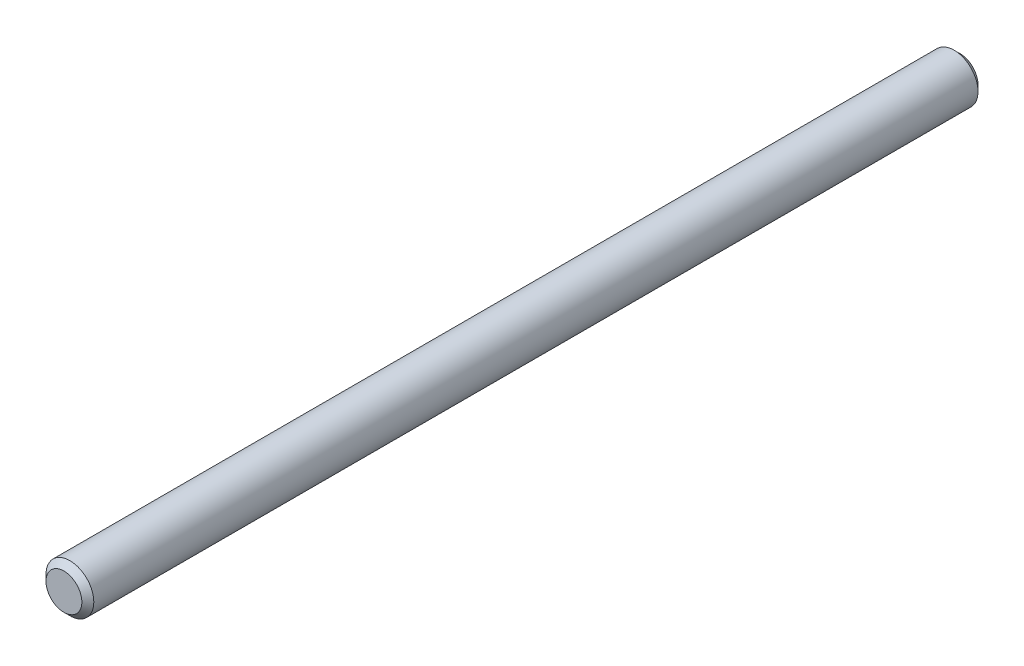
ISO-10303-21;
HEADER;
FILE_DESCRIPTION(('STEP AP214'),'2;1');
FILE_NAME('part.step','',(''),(''),'','','');
FILE_SCHEMA(('AUTOMOTIVE_DESIGN { 1 0 10303 214 1 1 1 1 }'));
ENDSEC;
DATA;
#1=APPLICATION_CONTEXT('core data for automotive mechanical design processes');
#2=APPLICATION_PROTOCOL_DEFINITION('international standard','automotive_design',2000,#1);
#3=PRODUCT_CONTEXT('',#1,'mechanical');
#4=PRODUCT('Part','Part','',(#3));
#5=PRODUCT_RELATED_PRODUCT_CATEGORY('part','',(#4));
#6=PRODUCT_DEFINITION_FORMATION('','',#4);
#7=PRODUCT_DEFINITION_CONTEXT('part definition',#1,'design');
#8=PRODUCT_DEFINITION('design','',#6,#7);
#9=PRODUCT_DEFINITION_SHAPE('','',#8);
#10=(LENGTH_UNIT() NAMED_UNIT(*) SI_UNIT(.MILLI.,.METRE.));
#11=(NAMED_UNIT(*) PLANE_ANGLE_UNIT() SI_UNIT($,.RADIAN.));
#12=(NAMED_UNIT(*) SI_UNIT($,.STERADIAN.) SOLID_ANGLE_UNIT());
#13=UNCERTAINTY_MEASURE_WITH_UNIT(LENGTH_MEASURE(1.E-05),#10,'distance_accuracy_value','');
#14=(GEOMETRIC_REPRESENTATION_CONTEXT(3) GLOBAL_UNCERTAINTY_ASSIGNED_CONTEXT((#13)) GLOBAL_UNIT_ASSIGNED_CONTEXT((#10,
#11,#12)) REPRESENTATION_CONTEXT('',''));
#15=CARTESIAN_POINT('',(0.,0.,0.));
#16=DIRECTION('',(0.,0.,1.));
#17=DIRECTION('',(1.,0.,0.));
#18=AXIS2_PLACEMENT_3D('',#15,#16,#17);
#19=CARTESIAN_POINT('',(0.,0.,150.));
#20=DIRECTION('',(0.,0.,-1.));
#21=DIRECTION('',(-1.,0.,0.));
#22=AXIS2_PLACEMENT_3D('',#19,#20,#21);
#23=CYLINDRICAL_SURFACE('',#22,4.);
#24=CARTESIAN_POINT('',(0.,0.,149.));
#25=DIRECTION('',(0.,0.,1.));
#26=DIRECTION('',(1.,0.,0.));
#27=AXIS2_PLACEMENT_3D('',#24,#25,#26);
#28=CIRCLE('',#27,4.);
#29=CARTESIAN_POINT('',(4.,0.,149.));
#30=VERTEX_POINT('',#29);
#31=EDGE_CURVE('E40',#30,#30,#28,.F.);
#32=ORIENTED_EDGE('',*,*,#31,.T.);
#33=EDGE_LOOP('',(#32));
#34=FACE_BOUND('',#33,.T.);
#35=CARTESIAN_POINT('',(0.,0.,1.));
#36=DIRECTION('',(0.,0.,1.));
#37=DIRECTION('',(1.,0.,0.));
#38=AXIS2_PLACEMENT_3D('',#35,#36,#37);
#39=CIRCLE('',#38,4.);
#40=CARTESIAN_POINT('',(4.,0.,1.));
#41=VERTEX_POINT('',#40);
#42=EDGE_CURVE('E44',#41,#41,#39,.T.);
#43=ORIENTED_EDGE('',*,*,#42,.T.);
#44=EDGE_LOOP('',(#43));
#45=FACE_BOUND('',#44,.T.);
#46=ADVANCED_FACE('F32',(#34,#45),#23,.T.);
#47=CARTESIAN_POINT('',(0.,0.,150.));
#48=DIRECTION('',(0.,0.,1.));
#49=DIRECTION('',(1.,0.,0.));
#50=AXIS2_PLACEMENT_3D('',#47,#48,#49);
#51=PLANE('',#50);
#52=CARTESIAN_POINT('',(0.,0.,150.));
#53=DIRECTION('',(0.,0.,1.));
#54=DIRECTION('',(1.,0.,0.));
#55=AXIS2_PLACEMENT_3D('',#52,#53,#54);
#56=CIRCLE('',#55,3.00000000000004);
#57=CARTESIAN_POINT('',(3.00000000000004,0.,150.));
#58=VERTEX_POINT('',#57);
#59=EDGE_CURVE('E48',#58,#58,#56,.T.);
#60=ORIENTED_EDGE('',*,*,#59,.T.);
#61=EDGE_LOOP('',(#60));
#62=FACE_BOUND('',#61,.T.);
#63=ADVANCED_FACE('F54',(#62),#51,.T.);
#64=CARTESIAN_POINT('',(0.,0.,0.));
#65=DIRECTION('',(0.,0.,1.));
#66=DIRECTION('',(1.,0.,0.));
#67=AXIS2_PLACEMENT_3D('',#64,#65,#66);
#68=PLANE('',#67);
#69=CARTESIAN_POINT('',(0.,0.,0.));
#70=DIRECTION('',(0.,0.,1.));
#71=DIRECTION('',(1.,0.,0.));
#72=AXIS2_PLACEMENT_3D('',#69,#70,#71);
#73=CIRCLE('',#72,3.);
#74=CARTESIAN_POINT('',(3.,0.,0.));
#75=VERTEX_POINT('',#74);
#76=EDGE_CURVE('E10',#75,#75,#73,.F.);
#77=ORIENTED_EDGE('',*,*,#76,.T.);
#78=EDGE_LOOP('',(#77));
#79=FACE_BOUND('',#78,.T.);
#80=ADVANCED_FACE('F58',(#79),#68,.F.);
#81=CARTESIAN_POINT('',(0.,0.,150.));
#82=DIRECTION('',(0.,0.,-1.));
#83=DIRECTION('',(-1.,0.,0.));
#84=AXIS2_PLACEMENT_3D('',#81,#82,#83);
#85=CONICAL_SURFACE('',#84,3.00000000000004,0.785398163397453);
#86=ORIENTED_EDGE('',*,*,#31,.F.);
#87=EDGE_LOOP('',(#86));
#88=FACE_BOUND('',#87,.T.);
#89=ORIENTED_EDGE('',*,*,#59,.F.);
#90=EDGE_LOOP('',(#89));
#91=FACE_BOUND('',#90,.T.);
#92=ADVANCED_FACE('F56',(#88,#91),#85,.T.);
#93=CARTESIAN_POINT('',(0.,0.,1.));
#94=DIRECTION('',(0.,0.,1.));
#95=DIRECTION('',(1.,0.,0.));
#96=AXIS2_PLACEMENT_3D('',#93,#94,#95);
#97=CONICAL_SURFACE('',#96,4.,0.785398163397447);
#98=ORIENTED_EDGE('',*,*,#76,.F.);
#99=EDGE_LOOP('',(#98));
#100=FACE_BOUND('',#99,.T.);
#101=ORIENTED_EDGE('',*,*,#42,.F.);
#102=EDGE_LOOP('',(#101));
#103=FACE_BOUND('',#102,.T.);
#104=ADVANCED_FACE('F35',(#100,#103),#97,.T.);
#105=CLOSED_SHELL('',(#46,#63,#80,#92,#104));
#106=MANIFOLD_SOLID_BREP('B2',#105);
#107=ADVANCED_BREP_SHAPE_REPRESENTATION('',(#18,#106),#14);
#108=SHAPE_DEFINITION_REPRESENTATION(#9,#107);
ENDSEC;
END-ISO-10303-21;
